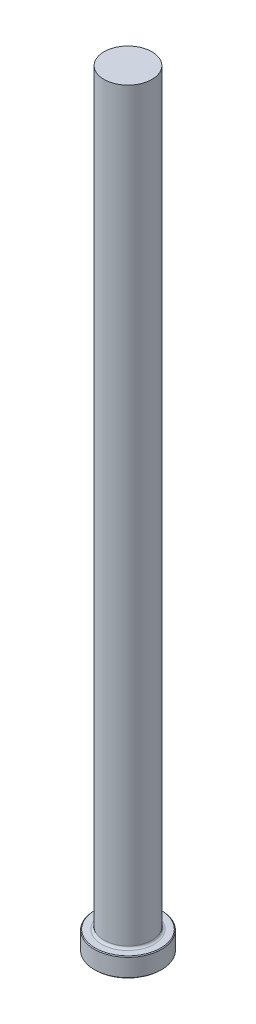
from build123d import *

# Parameters (mm, degrees)
CHAMFER1_SIZE = 0.254
FILLET1_R     = 0.762


with BuildPart() as part:
    # Sketch1 → Revolve1 (revolve)
    with BuildSketch(Plane.XY, mode=Mode.PRIVATE) as revolve1_sk:
        Polygon((0, 0), (-11.1125, 0), (-11.1125, 6.35), (-7.9375, 6.35), (-7.9375, 254), (0, 254), align=None)
    revolve(revolve1_sk.sketch.rotate(Axis((0, 259.958771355, 0), (0, -1, 0)), 270), axis=Axis((0, 259.958771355, 0), (0, -1, 0)))

    # Chamfer1
    chamfer1_edges = [part.edges().sort_by_distance(p)[0] for p in [
        (0, 6.35, -11.1125),
        (0, 0, -11.1125),
    ]]
    chamfer(chamfer1_edges, length=CHAMFER1_SIZE)

    # Fillet1
    fillet1_edges = [part.edges().sort_by_distance(p)[0] for p in [
        (0, 6.35, -7.9375),
    ]]
    fillet(fillet1_edges, radius=FILLET1_R)


solid = part.part
